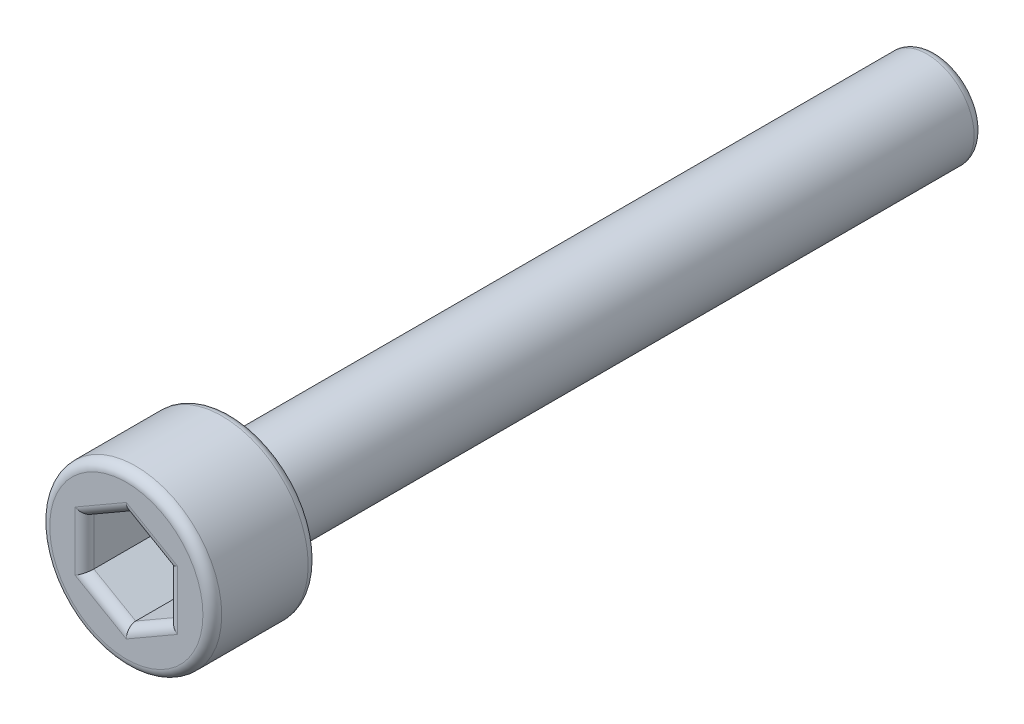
ISO-10303-21;
HEADER;
FILE_DESCRIPTION(('STEP AP214'),'2;1');
FILE_NAME('part.step','',(''),(''),'','','');
FILE_SCHEMA(('AUTOMOTIVE_DESIGN { 1 0 10303 214 1 1 1 1 }'));
ENDSEC;
DATA;
#1=APPLICATION_CONTEXT('core data for automotive mechanical design processes');
#2=APPLICATION_PROTOCOL_DEFINITION('international standard','automotive_design',2000,#1);
#3=PRODUCT_CONTEXT('',#1,'mechanical');
#4=PRODUCT('Part','Part','',(#3));
#5=PRODUCT_RELATED_PRODUCT_CATEGORY('part','',(#4));
#6=PRODUCT_DEFINITION_FORMATION('','',#4);
#7=PRODUCT_DEFINITION_CONTEXT('part definition',#1,'design');
#8=PRODUCT_DEFINITION('design','',#6,#7);
#9=PRODUCT_DEFINITION_SHAPE('','',#8);
#10=(LENGTH_UNIT() NAMED_UNIT(*) SI_UNIT(.MILLI.,.METRE.));
#11=(NAMED_UNIT(*) PLANE_ANGLE_UNIT() SI_UNIT($,.RADIAN.));
#12=(NAMED_UNIT(*) SI_UNIT($,.STERADIAN.) SOLID_ANGLE_UNIT());
#13=UNCERTAINTY_MEASURE_WITH_UNIT(LENGTH_MEASURE(1.E-05),#10,'distance_accuracy_value','');
#14=(GEOMETRIC_REPRESENTATION_CONTEXT(3) GLOBAL_UNCERTAINTY_ASSIGNED_CONTEXT((#13)) GLOBAL_UNIT_ASSIGNED_CONTEXT((#10,
#11,#12)) REPRESENTATION_CONTEXT('',''));
#15=CARTESIAN_POINT('',(0.,0.,0.));
#16=DIRECTION('',(0.,0.,1.));
#17=DIRECTION('',(1.,0.,0.));
#18=AXIS2_PLACEMENT_3D('',#15,#16,#17);
#19=CARTESIAN_POINT('',(0.,0.,19.05));
#20=DIRECTION('',(0.,0.,-1.));
#21=DIRECTION('',(-1.,0.,0.));
#22=AXIS2_PLACEMENT_3D('',#19,#20,#21);
#23=CYLINDRICAL_SURFACE('',#22,1.27);
#24=CARTESIAN_POINT('',(0.,0.,0.254000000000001));
#25=DIRECTION('',(0.,0.,1.));
#26=DIRECTION('',(1.,0.,0.));
#27=AXIS2_PLACEMENT_3D('',#24,#25,#26);
#28=CIRCLE('',#27,1.27);
#29=CARTESIAN_POINT('',(-1.27,0.,0.253999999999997));
#30=VERTEX_POINT('',#29);
#31=EDGE_CURVE('E37',#30,#30,#28,.T.);
#32=CARTESIAN_POINT('',(0.,0.,19.05));
#33=DIRECTION('',(0.,0.,1.));
#34=DIRECTION('',(1.,0.,0.));
#35=AXIS2_PLACEMENT_3D('',#32,#33,#34);
#36=CIRCLE('',#35,1.27);
#37=CARTESIAN_POINT('',(-1.27,0.,19.05));
#38=VERTEX_POINT('',#37);
#39=EDGE_CURVE('E143',#38,#38,#36,.T.);
#40=CARTESIAN_POINT('',(-1.27,0.,0.253999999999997));
#41=CARTESIAN_POINT('',(-1.27,0.,0.449791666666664));
#42=CARTESIAN_POINT('',(-1.27,0.,0.645583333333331));
#43=CARTESIAN_POINT('',(-1.27,0.,1.03716666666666));
#44=CARTESIAN_POINT('',(-1.27,0.,1.23295833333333));
#45=CARTESIAN_POINT('',(-1.27,0.,1.62454166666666));
#46=CARTESIAN_POINT('',(-1.27,0.,1.82033333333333));
#47=CARTESIAN_POINT('',(-1.27,0.,2.21191666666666));
#48=CARTESIAN_POINT('',(-1.27,0.,2.40770833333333));
#49=CARTESIAN_POINT('',(-1.27,0.,2.79929166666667));
#50=CARTESIAN_POINT('',(-1.27,0.,2.99508333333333));
#51=CARTESIAN_POINT('',(-1.27,0.,3.38666666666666));
#52=CARTESIAN_POINT('',(-1.27,0.,3.58245833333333));
#53=CARTESIAN_POINT('',(-1.27,0.,3.97404166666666));
#54=CARTESIAN_POINT('',(-1.27,0.,4.16983333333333));
#55=CARTESIAN_POINT('',(-1.27,0.,4.56141666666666));
#56=CARTESIAN_POINT('',(-1.27,0.,4.75720833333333));
#57=CARTESIAN_POINT('',(-1.27,0.,5.14879166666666));
#58=CARTESIAN_POINT('',(-1.27,0.,5.34458333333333));
#59=CARTESIAN_POINT('',(-1.27,0.,5.73616666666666));
#60=CARTESIAN_POINT('',(-1.27,0.,5.93195833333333));
#61=CARTESIAN_POINT('',(-1.27,0.,6.32354166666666));
#62=CARTESIAN_POINT('',(-1.27,0.,6.51933333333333));
#63=CARTESIAN_POINT('',(-1.27,0.,6.91091666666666));
#64=CARTESIAN_POINT('',(-1.27,0.,7.10670833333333));
#65=CARTESIAN_POINT('',(-1.27,0.,7.49829166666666));
#66=CARTESIAN_POINT('',(-1.27,0.,7.69408333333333));
#67=CARTESIAN_POINT('',(-1.27,0.,8.08566666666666));
#68=CARTESIAN_POINT('',(-1.27,0.,8.28145833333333));
#69=CARTESIAN_POINT('',(-1.27,0.,8.67304166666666));
#70=CARTESIAN_POINT('',(-1.27,0.,8.86883333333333));
#71=CARTESIAN_POINT('',(-1.27,0.,9.26041666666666));
#72=CARTESIAN_POINT('',(-1.27,0.,9.45620833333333));
#73=CARTESIAN_POINT('',(-1.27,0.,9.84779166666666));
#74=CARTESIAN_POINT('',(-1.27,0.,10.0435833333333));
#75=CARTESIAN_POINT('',(-1.27,0.,10.4351666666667));
#76=CARTESIAN_POINT('',(-1.27,0.,10.6309583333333));
#77=CARTESIAN_POINT('',(-1.27,0.,11.0225416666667));
#78=CARTESIAN_POINT('',(-1.27,0.,11.2183333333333));
#79=CARTESIAN_POINT('',(-1.27,0.,11.6099166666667));
#80=CARTESIAN_POINT('',(-1.27,0.,11.8057083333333));
#81=CARTESIAN_POINT('',(-1.27,0.,12.1972916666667));
#82=CARTESIAN_POINT('',(-1.27,0.,12.3930833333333));
#83=CARTESIAN_POINT('',(-1.27,0.,12.7846666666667));
#84=CARTESIAN_POINT('',(-1.27,0.,12.9804583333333));
#85=CARTESIAN_POINT('',(-1.27,0.,13.3720416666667));
#86=CARTESIAN_POINT('',(-1.27,0.,13.5678333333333));
#87=CARTESIAN_POINT('',(-1.27,0.,13.9594166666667));
#88=CARTESIAN_POINT('',(-1.27,0.,14.1552083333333));
#89=CARTESIAN_POINT('',(-1.27,0.,14.5467916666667));
#90=CARTESIAN_POINT('',(-1.27,0.,14.7425833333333));
#91=CARTESIAN_POINT('',(-1.27,0.,15.1341666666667));
#92=CARTESIAN_POINT('',(-1.27,0.,15.3299583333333));
#93=CARTESIAN_POINT('',(-1.27,0.,15.7215416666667));
#94=CARTESIAN_POINT('',(-1.27,0.,15.9173333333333));
#95=CARTESIAN_POINT('',(-1.27,0.,16.3089166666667));
#96=CARTESIAN_POINT('',(-1.27,0.,16.5047083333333));
#97=CARTESIAN_POINT('',(-1.27,0.,16.8962916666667));
#98=CARTESIAN_POINT('',(-1.27,0.,17.0920833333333));
#99=CARTESIAN_POINT('',(-1.27,0.,17.4836666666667));
#100=CARTESIAN_POINT('',(-1.27,0.,17.6794583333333));
#101=CARTESIAN_POINT('',(-1.27,0.,18.0710416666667));
#102=CARTESIAN_POINT('',(-1.27,0.,18.2668333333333));
#103=CARTESIAN_POINT('',(-1.27,0.,18.6584166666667));
#104=CARTESIAN_POINT('',(-1.27,0.,18.8542083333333));
#105=CARTESIAN_POINT('',(-1.27,0.,19.05));
#106=B_SPLINE_CURVE_WITH_KNOTS('',3,(#40,#41,#42,#43,#44,#45,#46,#47,#48,#49,#50,#51,#52,#53,
#54,#55,#56,#57,#58,#59,#60,#61,#62,#63,#64,#65,#66,#67,#68,#69,#70,#71,#72,#73,#74,#75,#76,#77,
#78,#79,#80,#81,#82,#83,#84,#85,#86,#87,#88,#89,#90,#91,#92,#93,#94,#95,#96,#97,#98,#99,#100,
#101,#102,#103,#104,#105),.UNSPECIFIED.,.F.,.F.,(4,2,2,2,2,2,2,2,2,2,2,2,2,2,2,2,2,2,2,2,2,2,2,
2,2,2,2,2,2,2,2,2,4),(0.,0.587375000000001,1.17475,1.762125,2.3495,2.936875,3.52425,4.111625,
4.699,5.286375,5.87375,6.461125,7.0485,7.635875,8.22325,8.810625,9.398,9.985375,10.57275,
11.160125,11.7475,12.334875,12.92225,13.509625,14.097,14.684375,15.27175,15.859125,16.4465,
17.033875,17.62125,18.208625,18.796),.UNSPECIFIED.);
#107=EDGE_CURVE('BSEAM30',#30,#38,#106,.T.);
#108=ORIENTED_EDGE('',*,*,#31,.T.);
#109=ORIENTED_EDGE('',*,*,#39,.F.);
#110=ORIENTED_EDGE('',*,*,#107,.T.);
#111=ORIENTED_EDGE('',*,*,#107,.F.);
#112=EDGE_LOOP('',(#108,#110,#109,#111));
#113=FACE_BOUND('',#112,.T.);
#114=ADVANCED_FACE('F30',(#113),#23,.T.);
#115=CARTESIAN_POINT('',(0.,0.,0.));
#116=DIRECTION('',(0.,0.,1.));
#117=DIRECTION('',(1.,0.,0.));
#118=AXIS2_PLACEMENT_3D('',#115,#116,#117);
#119=PLANE('',#118);
#120=CARTESIAN_POINT('',(0.,0.,0.));
#121=DIRECTION('',(0.,0.,1.));
#122=DIRECTION('',(1.,0.,0.));
#123=AXIS2_PLACEMENT_3D('',#120,#121,#122);
#124=CIRCLE('',#123,1.016);
#125=CARTESIAN_POINT('',(1.016,0.,0.));
#126=VERTEX_POINT('',#125);
#127=EDGE_CURVE('E11',#126,#126,#124,.F.);
#128=ORIENTED_EDGE('',*,*,#127,.T.);
#129=EDGE_LOOP('',(#128));
#130=FACE_BOUND('',#129,.T.);
#131=ADVANCED_FACE('F204',(#130),#119,.F.);
#132=CARTESIAN_POINT('',(0.,0.,19.05));
#133=DIRECTION('',(0.,0.,1.));
#134=DIRECTION('',(1.,0.,0.));
#135=AXIS2_PLACEMENT_3D('',#132,#133,#134);
#136=PLANE('',#135);
#137=CARTESIAN_POINT('',(0.,0.,19.05));
#138=DIRECTION('',(0.,0.,1.));
#139=DIRECTION('',(1.,0.,0.));
#140=AXIS2_PLACEMENT_3D('',#137,#138,#139);
#141=CIRCLE('',#140,2.0701);
#142=CARTESIAN_POINT('',(2.0701,0.,19.05));
#143=VERTEX_POINT('',#142);
#144=EDGE_CURVE('E181',#143,#143,#141,.F.);
#145=ORIENTED_EDGE('',*,*,#144,.T.);
#146=EDGE_LOOP('',(#145));
#147=FACE_BOUND('',#146,.T.);
#148=ORIENTED_EDGE('',*,*,#39,.T.);
#149=EDGE_LOOP('',(#148));
#150=FACE_BOUND('',#149,.T.);
#151=ADVANCED_FACE('F208',(#147,#150),#136,.F.);
#152=CARTESIAN_POINT('',(0.,0.,21.8948));
#153=DIRECTION('',(0.,0.,-1.));
#154=DIRECTION('',(-1.,0.,0.));
#155=AXIS2_PLACEMENT_3D('',#152,#153,#154);
#156=CYLINDRICAL_SURFACE('',#155,2.3241);
#157=CARTESIAN_POINT('',(0.,0.,19.304));
#158=DIRECTION('',(0.,0.,1.));
#159=DIRECTION('',(1.,0.,0.));
#160=AXIS2_PLACEMENT_3D('',#157,#158,#159);
#161=CIRCLE('',#160,2.3241);
#162=CARTESIAN_POINT('',(2.3241,0.,19.304));
#163=VERTEX_POINT('',#162);
#164=EDGE_CURVE('E178',#163,#163,#161,.T.);
#165=ORIENTED_EDGE('',*,*,#164,.T.);
#166=EDGE_LOOP('',(#165));
#167=FACE_BOUND('',#166,.T.);
#168=CARTESIAN_POINT('',(0.,0.,21.6408));
#169=DIRECTION('',(0.,0.,1.));
#170=DIRECTION('',(1.,0.,0.));
#171=AXIS2_PLACEMENT_3D('',#168,#169,#170);
#172=CIRCLE('',#171,2.3241);
#173=CARTESIAN_POINT('',(2.3241,0.,21.6408));
#174=VERTEX_POINT('',#173);
#175=EDGE_CURVE('E175',#174,#174,#172,.F.);
#176=ORIENTED_EDGE('',*,*,#175,.T.);
#177=EDGE_LOOP('',(#176));
#178=FACE_BOUND('',#177,.T.);
#179=ADVANCED_FACE('F213',(#167,#178),#156,.T.);
#180=CARTESIAN_POINT('',(0.,0.,21.8948));
#181=DIRECTION('',(0.,0.,1.));
#182=DIRECTION('',(1.,0.,0.));
#183=AXIS2_PLACEMENT_3D('',#180,#181,#182);
#184=PLANE('',#183);
#185=CARTESIAN_POINT('',(0.,0.,21.8948));
#186=DIRECTION('',(0.,0.,1.));
#187=DIRECTION('',(1.,0.,0.));
#188=AXIS2_PLACEMENT_3D('',#185,#186,#187);
#189=CIRCLE('',#188,2.0701);
#190=CARTESIAN_POINT('',(2.0701,0.,21.8948));
#191=VERTEX_POINT('',#190);
#192=EDGE_CURVE('E184',#191,#191,#189,.T.);
#193=ORIENTED_EDGE('',*,*,#192,.T.);
#194=EDGE_LOOP('',(#193));
#195=FACE_BOUND('',#194,.T.);
#196=DIRECTION('',(0.866025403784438,0.500000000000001,0.));
#197=VECTOR('',#196,1.);
#198=CARTESIAN_POINT('',(0.127,-1.52479532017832,21.8948));
#199=LINE('',#198,#197);
#200=CARTESIAN_POINT('',(1.38401148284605,-0.799059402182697,21.8948));
#201=VERTEX_POINT('',#200);
#202=CARTESIAN_POINT('',(0.,-1.5981188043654,21.8948));
#203=VERTEX_POINT('',#202);
#204=EDGE_CURVE('E162',#201,#203,#199,.F.);
#205=ORIENTED_EDGE('',*,*,#204,.T.);
#206=DIRECTION('',(0.866025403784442,-0.499999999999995,0.));
#207=VECTOR('',#206,1.);
#208=CARTESIAN_POINT('',(-1.25701148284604,-0.872382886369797,21.8948));
#209=LINE('',#208,#207);
#210=CARTESIAN_POINT('',(-1.38401148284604,-0.799059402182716,21.8948));
#211=VERTEX_POINT('',#210);
#212=EDGE_CURVE('E164',#203,#211,#209,.F.);
#213=ORIENTED_EDGE('',*,*,#212,.T.);
#214=DIRECTION('',(0.,-1.,0.));
#215=VECTOR('',#214,1.);
#216=CARTESIAN_POINT('',(-1.38401148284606,0.652412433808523,21.8948));
#217=LINE('',#216,#215);
#218=CARTESIAN_POINT('',(-1.38401148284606,0.799059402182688,21.8948));
#219=VERTEX_POINT('',#218);
#220=EDGE_CURVE('E154',#211,#219,#217,.F.);
#221=ORIENTED_EDGE('',*,*,#220,.T.);
#222=DIRECTION('',(-0.866025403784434,-0.500000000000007,0.));
#223=VECTOR('',#222,1.);
#224=CARTESIAN_POINT('',(-0.127000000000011,1.52479532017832,21.8948));
#225=LINE('',#224,#223);
#226=CARTESIAN_POINT('',(0.,1.5981188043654,21.8948));
#227=VERTEX_POINT('',#226);
#228=EDGE_CURVE('E156',#219,#227,#225,.F.);
#229=ORIENTED_EDGE('',*,*,#228,.T.);
#230=DIRECTION('',(-0.866025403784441,0.499999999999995,0.));
#231=VECTOR('',#230,1.);
#232=CARTESIAN_POINT('',(1.25701148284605,0.872382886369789,21.8948));
#233=LINE('',#232,#231);
#234=CARTESIAN_POINT('',(1.38401148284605,0.799059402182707,21.8948));
#235=VERTEX_POINT('',#234);
#236=EDGE_CURVE('E158',#227,#235,#233,.F.);
#237=ORIENTED_EDGE('',*,*,#236,.T.);
#238=DIRECTION('',(0.,1.,0.));
#239=VECTOR('',#238,1.);
#240=CARTESIAN_POINT('',(1.38401148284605,-0.652412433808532,21.8948));
#241=LINE('',#240,#239);
#242=EDGE_CURVE('E160',#235,#201,#241,.F.);
#243=ORIENTED_EDGE('',*,*,#242,.T.);
#244=EDGE_LOOP('',(#205,#213,#221,#229,#237,#243));
#245=FACE_BOUND('',#244,.T.);
#246=ADVANCED_FACE('F219',(#195,#245),#184,.T.);
#247=CARTESIAN_POINT('',(-1.13001148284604,-0.652412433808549,19.8628));
#248=DIRECTION('',(-0.499999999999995,-0.866025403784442,0.));
#249=DIRECTION('',(0.866025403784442,-0.499999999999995,0.));
#250=AXIS2_PLACEMENT_3D('',#247,#248,#249);
#251=PLANE('',#250);
#252=DIRECTION('',(0.,0.,1.));
#253=VECTOR('',#252,1.);
#254=CARTESIAN_POINT('',(-1.13001148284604,-0.652412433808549,19.8628));
#255=LINE('',#254,#253);
#256=CARTESIAN_POINT('',(-1.13001148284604,-0.652412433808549,19.8628));
#257=VERTEX_POINT('',#256);
#258=CARTESIAN_POINT('',(-1.13001148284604,-0.652412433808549,21.6408));
#259=VERTEX_POINT('',#258);
#260=EDGE_CURVE('E141',#257,#259,#255,.T.);
#261=ORIENTED_EDGE('',*,*,#260,.T.);
#262=DIRECTION('',(0.866025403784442,-0.499999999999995,0.));
#263=VECTOR('',#262,1.);
#264=CARTESIAN_POINT('',(0.,-1.30482486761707,21.6408));
#265=LINE('',#264,#263);
#266=CARTESIAN_POINT('',(0.,-1.30482486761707,21.6408));
#267=VERTEX_POINT('',#266);
#268=EDGE_CURVE('E110',#259,#267,#265,.T.);
#269=ORIENTED_EDGE('',*,*,#268,.T.);
#270=DIRECTION('',(0.,0.,1.));
#271=VECTOR('',#270,1.);
#272=CARTESIAN_POINT('',(0.,-1.30482486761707,19.8628));
#273=LINE('',#272,#271);
#274=CARTESIAN_POINT('',(0.,-1.30482486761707,19.8628));
#275=VERTEX_POINT('',#274);
#276=EDGE_CURVE('E102',#275,#267,#273,.T.);
#277=ORIENTED_EDGE('',*,*,#276,.F.);
#278=DIRECTION('',(0.866025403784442,-0.499999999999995,0.));
#279=VECTOR('',#278,1.);
#280=CARTESIAN_POINT('',(-1.13001148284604,-0.652412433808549,19.8628));
#281=LINE('',#280,#279);
#282=EDGE_CURVE('E107',#257,#275,#281,.T.);
#283=ORIENTED_EDGE('',*,*,#282,.F.);
#284=EDGE_LOOP('',(#261,#269,#277,#283));
#285=FACE_BOUND('',#284,.T.);
#286=ADVANCED_FACE('F105',(#285),#251,.F.);
#287=CARTESIAN_POINT('',(-1.13001148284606,0.652412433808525,19.8628));
#288=DIRECTION('',(-1.,0.,0.));
#289=DIRECTION('',(0.,-1.,0.));
#290=AXIS2_PLACEMENT_3D('',#287,#288,#289);
#291=PLANE('',#290);
#292=DIRECTION('',(0.,0.,1.));
#293=VECTOR('',#292,1.);
#294=CARTESIAN_POINT('',(-1.13001148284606,0.652412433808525,19.8628));
#295=LINE('',#294,#293);
#296=CARTESIAN_POINT('',(-1.13001148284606,0.652412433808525,19.8628));
#297=VERTEX_POINT('',#296);
#298=CARTESIAN_POINT('',(-1.13001148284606,0.652412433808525,21.6408));
#299=VERTEX_POINT('',#298);
#300=EDGE_CURVE('E144',#297,#299,#295,.T.);
#301=ORIENTED_EDGE('',*,*,#300,.T.);
#302=DIRECTION('',(0.,-1.,0.));
#303=VECTOR('',#302,1.);
#304=CARTESIAN_POINT('',(-1.13001148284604,-0.652412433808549,21.6408));
#305=LINE('',#304,#303);
#306=EDGE_CURVE('E173',#299,#259,#305,.T.);
#307=ORIENTED_EDGE('',*,*,#306,.T.);
#308=ORIENTED_EDGE('',*,*,#260,.F.);
#309=DIRECTION('',(0.,-1.,0.));
#310=VECTOR('',#309,1.);
#311=CARTESIAN_POINT('',(-1.13001148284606,0.652412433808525,19.8628));
#312=LINE('',#311,#310);
#313=EDGE_CURVE('E113',#297,#257,#312,.T.);
#314=ORIENTED_EDGE('',*,*,#313,.F.);
#315=EDGE_LOOP('',(#301,#307,#308,#314));
#316=FACE_BOUND('',#315,.T.);
#317=ADVANCED_FACE('F226',(#316),#291,.F.);
#318=CARTESIAN_POINT('',(0.,1.30482486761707,19.8628));
#319=DIRECTION('',(-0.500000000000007,0.866025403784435,0.));
#320=DIRECTION('',(-0.866025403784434,-0.500000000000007,0.));
#321=AXIS2_PLACEMENT_3D('',#318,#319,#320);
#322=PLANE('',#321);
#323=DIRECTION('',(0.,0.,1.));
#324=VECTOR('',#323,1.);
#325=CARTESIAN_POINT('',(0.,1.30482486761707,19.8628));
#326=LINE('',#325,#324);
#327=CARTESIAN_POINT('',(0.,1.30482486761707,19.8628));
#328=VERTEX_POINT('',#327);
#329=CARTESIAN_POINT('',(0.,1.30482486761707,21.6408));
#330=VERTEX_POINT('',#329);
#331=EDGE_CURVE('E146',#328,#330,#326,.T.);
#332=ORIENTED_EDGE('',*,*,#331,.T.);
#333=DIRECTION('',(-0.866025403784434,-0.500000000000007,0.));
#334=VECTOR('',#333,1.);
#335=CARTESIAN_POINT('',(-1.13001148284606,0.652412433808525,21.6408));
#336=LINE('',#335,#334);
#337=EDGE_CURVE('E44',#330,#299,#336,.T.);
#338=ORIENTED_EDGE('',*,*,#337,.T.);
#339=ORIENTED_EDGE('',*,*,#300,.F.);
#340=DIRECTION('',(-0.866025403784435,-0.500000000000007,0.));
#341=VECTOR('',#340,1.);
#342=CARTESIAN_POINT('',(0.,1.30482486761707,19.8628));
#343=LINE('',#342,#341);
#344=EDGE_CURVE('E138',#328,#297,#343,.T.);
#345=ORIENTED_EDGE('',*,*,#344,.F.);
#346=EDGE_LOOP('',(#332,#338,#339,#345));
#347=FACE_BOUND('',#346,.T.);
#348=ADVANCED_FACE('F236',(#347),#322,.F.);
#349=CARTESIAN_POINT('',(1.13001148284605,0.652412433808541,19.8628));
#350=DIRECTION('',(0.499999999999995,0.866025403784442,0.));
#351=DIRECTION('',(-0.866025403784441,0.499999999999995,0.));
#352=AXIS2_PLACEMENT_3D('',#349,#350,#351);
#353=PLANE('',#352);
#354=DIRECTION('',(0.,0.,1.));
#355=VECTOR('',#354,1.);
#356=CARTESIAN_POINT('',(1.13001148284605,0.652412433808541,19.8628));
#357=LINE('',#356,#355);
#358=CARTESIAN_POINT('',(1.13001148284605,0.652412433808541,19.8628));
#359=VERTEX_POINT('',#358);
#360=CARTESIAN_POINT('',(1.13001148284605,0.652412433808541,21.6408));
#361=VERTEX_POINT('',#360);
#362=EDGE_CURVE('E148',#359,#361,#357,.T.);
#363=ORIENTED_EDGE('',*,*,#362,.T.);
#364=DIRECTION('',(-0.866025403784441,0.499999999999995,0.));
#365=VECTOR('',#364,1.);
#366=CARTESIAN_POINT('',(0.,1.30482486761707,21.6408));
#367=LINE('',#366,#365);
#368=EDGE_CURVE('E52',#361,#330,#367,.T.);
#369=ORIENTED_EDGE('',*,*,#368,.T.);
#370=ORIENTED_EDGE('',*,*,#331,.F.);
#371=DIRECTION('',(-0.866025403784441,0.499999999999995,0.));
#372=VECTOR('',#371,1.);
#373=CARTESIAN_POINT('',(1.13001148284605,0.652412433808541,19.8628));
#374=LINE('',#373,#372);
#375=EDGE_CURVE('E135',#359,#328,#374,.T.);
#376=ORIENTED_EDGE('',*,*,#375,.F.);
#377=EDGE_LOOP('',(#363,#369,#370,#376));
#378=FACE_BOUND('',#377,.T.);
#379=ADVANCED_FACE('F232',(#378),#353,.F.);
#380=CARTESIAN_POINT('',(1.13001148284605,-0.652412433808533,19.8628));
#381=DIRECTION('',(1.,0.,0.));
#382=DIRECTION('',(0.,1.,0.));
#383=AXIS2_PLACEMENT_3D('',#380,#381,#382);
#384=PLANE('',#383);
#385=DIRECTION('',(0.,0.,1.));
#386=VECTOR('',#385,1.);
#387=CARTESIAN_POINT('',(1.13001148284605,-0.652412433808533,19.8628));
#388=LINE('',#387,#386);
#389=CARTESIAN_POINT('',(1.13001148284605,-0.652412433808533,19.8628));
#390=VERTEX_POINT('',#389);
#391=CARTESIAN_POINT('',(1.13001148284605,-0.652412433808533,21.6408));
#392=VERTEX_POINT('',#391);
#393=EDGE_CURVE('E112',#390,#392,#388,.T.);
#394=ORIENTED_EDGE('',*,*,#393,.T.);
#395=DIRECTION('',(0.,1.,0.));
#396=VECTOR('',#395,1.);
#397=CARTESIAN_POINT('',(1.13001148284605,0.652412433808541,21.6408));
#398=LINE('',#397,#396);
#399=EDGE_CURVE('E169',#392,#361,#398,.T.);
#400=ORIENTED_EDGE('',*,*,#399,.T.);
#401=ORIENTED_EDGE('',*,*,#362,.F.);
#402=DIRECTION('',(0.,1.,0.));
#403=VECTOR('',#402,1.);
#404=CARTESIAN_POINT('',(1.13001148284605,-0.652412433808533,19.8628));
#405=LINE('',#404,#403);
#406=EDGE_CURVE('E122',#390,#359,#405,.T.);
#407=ORIENTED_EDGE('',*,*,#406,.F.);
#408=EDGE_LOOP('',(#394,#400,#401,#407));
#409=FACE_BOUND('',#408,.T.);
#410=ADVANCED_FACE('F229',(#409),#384,.F.);
#411=CARTESIAN_POINT('',(0.,-1.30482486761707,19.8628));
#412=DIRECTION('',(0.500000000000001,-0.866025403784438,0.));
#413=DIRECTION('',(0.866025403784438,0.500000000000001,0.));
#414=AXIS2_PLACEMENT_3D('',#411,#412,#413);
#415=PLANE('',#414);
#416=ORIENTED_EDGE('',*,*,#276,.T.);
#417=DIRECTION('',(0.866025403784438,0.500000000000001,0.));
#418=VECTOR('',#417,1.);
#419=CARTESIAN_POINT('',(1.13001148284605,-0.652412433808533,21.6408));
#420=LINE('',#419,#418);
#421=EDGE_CURVE('E167',#267,#392,#420,.T.);
#422=ORIENTED_EDGE('',*,*,#421,.T.);
#423=ORIENTED_EDGE('',*,*,#393,.F.);
#424=DIRECTION('',(0.866025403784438,0.500000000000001,0.));
#425=VECTOR('',#424,1.);
#426=CARTESIAN_POINT('',(0.,-1.30482486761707,19.8628));
#427=LINE('',#426,#425);
#428=EDGE_CURVE('E116',#275,#390,#427,.T.);
#429=ORIENTED_EDGE('',*,*,#428,.F.);
#430=EDGE_LOOP('',(#416,#422,#423,#429));
#431=FACE_BOUND('',#430,.T.);
#432=ADVANCED_FACE('F117',(#431),#415,.F.);
#433=CARTESIAN_POINT('',(1.13001148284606,-1.9572373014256,19.8628));
#434=DIRECTION('',(0.,0.,1.));
#435=DIRECTION('',(1.,0.,0.));
#436=AXIS2_PLACEMENT_3D('',#433,#434,#435);
#437=PLANE('',#436);
#438=ORIENTED_EDGE('',*,*,#282,.T.);
#439=ORIENTED_EDGE('',*,*,#428,.T.);
#440=ORIENTED_EDGE('',*,*,#406,.T.);
#441=ORIENTED_EDGE('',*,*,#375,.T.);
#442=ORIENTED_EDGE('',*,*,#344,.T.);
#443=ORIENTED_EDGE('',*,*,#313,.T.);
#444=EDGE_LOOP('',(#438,#439,#440,#441,#442,#443));
#445=FACE_BOUND('',#444,.T.);
#446=ADVANCED_FACE('F124',(#445),#437,.T.);
#447=CARTESIAN_POINT('',(1.25701148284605,0.872382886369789,21.6408));
#448=DIRECTION('',(0.866025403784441,-0.499999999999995,0.));
#449=DIRECTION('',(0.499999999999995,0.866025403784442,0.));
#450=AXIS2_PLACEMENT_3D('',#447,#448,#449);
#451=CYLINDRICAL_SURFACE('',#450,0.254);
#452=CARTESIAN_POINT('',(1.38401148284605,0.799059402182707,21.6408));
#453=DIRECTION('',(0.500000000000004,-0.866025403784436,0.));
#454=DIRECTION('',(-0.866025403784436,-0.500000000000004,0.));
#455=AXIS2_PLACEMENT_3D('',#452,#453,#454);
#456=ELLIPSE('',#455,0.29329393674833,0.254);
#457=EDGE_CURVE('E130',#235,#361,#456,.T.);
#458=ORIENTED_EDGE('',*,*,#457,.F.);
#459=ORIENTED_EDGE('',*,*,#236,.F.);
#460=CARTESIAN_POINT('',(0.,1.5981188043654,21.6408));
#461=DIRECTION('',(1.,0.,0.));
#462=DIRECTION('',(0.,-1.,0.));
#463=AXIS2_PLACEMENT_3D('',#460,#461,#462);
#464=ELLIPSE('',#463,0.29329393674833,0.254);
#465=EDGE_CURVE('E127',#330,#227,#464,.F.);
#466=ORIENTED_EDGE('',*,*,#465,.F.);
#467=ORIENTED_EDGE('',*,*,#368,.F.);
#468=EDGE_LOOP('',(#458,#459,#466,#467));
#469=FACE_BOUND('',#468,.T.);
#470=ADVANCED_FACE('F244',(#469),#451,.T.);
#471=CARTESIAN_POINT('',(-0.127000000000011,1.52479532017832,21.6408));
#472=DIRECTION('',(0.866025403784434,0.500000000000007,0.));
#473=DIRECTION('',(-0.500000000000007,0.866025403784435,0.));
#474=AXIS2_PLACEMENT_3D('',#471,#472,#473);
#475=CYLINDRICAL_SURFACE('',#474,0.254);
#476=ORIENTED_EDGE('',*,*,#465,.T.);
#477=ORIENTED_EDGE('',*,*,#228,.F.);
#478=CARTESIAN_POINT('',(-1.38401148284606,0.799059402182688,21.6408));
#479=DIRECTION('',(0.499999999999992,0.866025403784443,0.));
#480=DIRECTION('',(0.866025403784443,-0.499999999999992,0.));
#481=AXIS2_PLACEMENT_3D('',#478,#479,#480);
#482=ELLIPSE('',#481,0.29329393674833,0.254);
#483=EDGE_CURVE('E296',#299,#219,#482,.F.);
#484=ORIENTED_EDGE('',*,*,#483,.F.);
#485=ORIENTED_EDGE('',*,*,#337,.F.);
#486=EDGE_LOOP('',(#476,#477,#484,#485));
#487=FACE_BOUND('',#486,.T.);
#488=ADVANCED_FACE('F247',(#487),#475,.T.);
#489=CARTESIAN_POINT('',(1.38401148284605,-0.652412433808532,21.6408));
#490=DIRECTION('',(0.,-1.,0.));
#491=DIRECTION('',(1.,0.,0.));
#492=AXIS2_PLACEMENT_3D('',#489,#490,#491);
#493=CYLINDRICAL_SURFACE('',#492,0.254);
#494=ORIENTED_EDGE('',*,*,#457,.T.);
#495=ORIENTED_EDGE('',*,*,#399,.F.);
#496=CARTESIAN_POINT('',(1.38401148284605,-0.799059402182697,21.6408));
#497=DIRECTION('',(-0.499999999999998,-0.86602540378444,0.));
#498=DIRECTION('',(-0.86602540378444,0.499999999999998,0.));
#499=AXIS2_PLACEMENT_3D('',#496,#497,#498);
#500=ELLIPSE('',#499,0.29329393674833,0.254);
#501=EDGE_CURVE('E292',#201,#392,#500,.T.);
#502=ORIENTED_EDGE('',*,*,#501,.F.);
#503=ORIENTED_EDGE('',*,*,#242,.F.);
#504=EDGE_LOOP('',(#494,#495,#502,#503));
#505=FACE_BOUND('',#504,.T.);
#506=ADVANCED_FACE('F251',(#505),#493,.T.);
#507=CARTESIAN_POINT('',(-1.38401148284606,0.652412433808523,21.6408));
#508=DIRECTION('',(0.,1.,0.));
#509=DIRECTION('',(-1.,0.,0.));
#510=AXIS2_PLACEMENT_3D('',#507,#508,#509);
#511=CYLINDRICAL_SURFACE('',#510,0.254);
#512=ORIENTED_EDGE('',*,*,#483,.T.);
#513=ORIENTED_EDGE('',*,*,#220,.F.);
#514=CARTESIAN_POINT('',(-1.38401148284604,-0.799059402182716,21.6408));
#515=DIRECTION('',(-0.500000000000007,0.866025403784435,0.));
#516=DIRECTION('',(-0.866025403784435,-0.500000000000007,0.));
#517=AXIS2_PLACEMENT_3D('',#514,#515,#516);
#518=ELLIPSE('',#517,0.293293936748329,0.254);
#519=EDGE_CURVE('E289',#259,#211,#518,.F.);
#520=ORIENTED_EDGE('',*,*,#519,.F.);
#521=ORIENTED_EDGE('',*,*,#306,.F.);
#522=EDGE_LOOP('',(#512,#513,#520,#521));
#523=FACE_BOUND('',#522,.T.);
#524=ADVANCED_FACE('F255',(#523),#511,.T.);
#525=CARTESIAN_POINT('',(0.127,-1.52479532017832,21.6408));
#526=DIRECTION('',(-0.866025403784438,-0.500000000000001,0.));
#527=DIRECTION('',(0.500000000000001,-0.866025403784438,0.));
#528=AXIS2_PLACEMENT_3D('',#525,#526,#527);
#529=CYLINDRICAL_SURFACE('',#528,0.254);
#530=ORIENTED_EDGE('',*,*,#501,.T.);
#531=ORIENTED_EDGE('',*,*,#421,.F.);
#532=CARTESIAN_POINT('',(0.,-1.5981188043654,21.6408));
#533=DIRECTION('',(-1.,0.,0.));
#534=DIRECTION('',(0.,1.,0.));
#535=AXIS2_PLACEMENT_3D('',#532,#533,#534);
#536=ELLIPSE('',#535,0.293293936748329,0.254);
#537=EDGE_CURVE('E286',#203,#267,#536,.T.);
#538=ORIENTED_EDGE('',*,*,#537,.F.);
#539=ORIENTED_EDGE('',*,*,#204,.F.);
#540=EDGE_LOOP('',(#530,#531,#538,#539));
#541=FACE_BOUND('',#540,.T.);
#542=ADVANCED_FACE('F259',(#541),#529,.T.);
#543=CARTESIAN_POINT('',(-1.25701148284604,-0.872382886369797,21.6408));
#544=DIRECTION('',(-0.866025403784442,0.499999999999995,0.));
#545=DIRECTION('',(-0.499999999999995,-0.866025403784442,0.));
#546=AXIS2_PLACEMENT_3D('',#543,#544,#545);
#547=CYLINDRICAL_SURFACE('',#546,0.254);
#548=ORIENTED_EDGE('',*,*,#519,.T.);
#549=ORIENTED_EDGE('',*,*,#212,.F.);
#550=ORIENTED_EDGE('',*,*,#537,.T.);
#551=ORIENTED_EDGE('',*,*,#268,.F.);
#552=EDGE_LOOP('',(#548,#549,#550,#551));
#553=FACE_BOUND('',#552,.T.);
#554=ADVANCED_FACE('F263',(#553),#547,.T.);
#555=CARTESIAN_POINT('',(0.,0.,19.304));
#556=DIRECTION('',(0.,0.,1.));
#557=DIRECTION('',(1.,0.,0.));
#558=AXIS2_PLACEMENT_3D('',#555,#556,#557);
#559=TOROIDAL_SURFACE('',#558,2.0701,0.254);
#560=ORIENTED_EDGE('',*,*,#144,.F.);
#561=EDGE_LOOP('',(#560));
#562=FACE_BOUND('',#561,.T.);
#563=ORIENTED_EDGE('',*,*,#164,.F.);
#564=EDGE_LOOP('',(#563));
#565=FACE_BOUND('',#564,.T.);
#566=ADVANCED_FACE('F199',(#562,#565),#559,.T.);
#567=CARTESIAN_POINT('',(0.,0.,21.6408));
#568=DIRECTION('',(0.,0.,1.));
#569=DIRECTION('',(1.,0.,0.));
#570=AXIS2_PLACEMENT_3D('',#567,#568,#569);
#571=TOROIDAL_SURFACE('',#570,2.0701,0.254);
#572=ORIENTED_EDGE('',*,*,#175,.F.);
#573=EDGE_LOOP('',(#572));
#574=FACE_BOUND('',#573,.T.);
#575=ORIENTED_EDGE('',*,*,#192,.F.);
#576=EDGE_LOOP('',(#575));
#577=FACE_BOUND('',#576,.T.);
#578=ADVANCED_FACE('F193',(#574,#577),#571,.T.);
#579=CARTESIAN_POINT('',(0.,0.,0.254000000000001));
#580=DIRECTION('',(0.,0.,1.));
#581=DIRECTION('',(1.,0.,0.));
#582=AXIS2_PLACEMENT_3D('',#579,#580,#581);
#583=TOROIDAL_SURFACE('',#582,1.016,0.254);
#584=ORIENTED_EDGE('',*,*,#127,.F.);
#585=EDGE_LOOP('',(#584));
#586=FACE_BOUND('',#585,.T.);
#587=ORIENTED_EDGE('',*,*,#31,.F.);
#588=EDGE_LOOP('',(#587));
#589=FACE_BOUND('',#588,.T.);
#590=ADVANCED_FACE('F191',(#586,#589),#583,.T.);
#591=CLOSED_SHELL('',(#114,#131,#151,#179,#246,#286,#317,#348,#379,#410,#432,#446,#470,#488,
#506,#524,#542,#554,#566,#578,#590));
#592=MANIFOLD_SOLID_BREP('B2',#591);
#593=ADVANCED_BREP_SHAPE_REPRESENTATION('',(#18,#592),#14);
#594=SHAPE_DEFINITION_REPRESENTATION(#9,#593);
ENDSEC;
END-ISO-10303-21;
